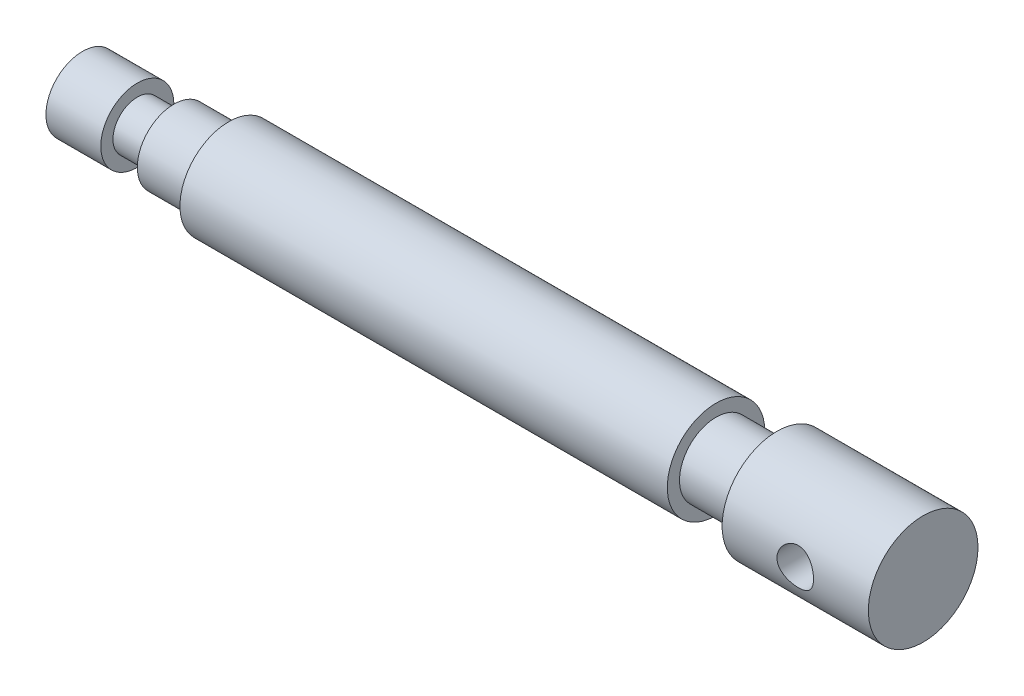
from build123d import *

# Parameters (mm, degrees)
SKETCH2_R          = 3
CUT_EXTRUDE1_DEPTH = 10


with BuildPart() as part:
    # Sketch1 → Revolve1 (revolve)
    with BuildSketch(Plane.XY, mode=Mode.PRIVATE) as revolve1_sk:
        Polygon((0, 0), (0, 6), (9, 6), (9, 4), (15, 4), (15, 6), (24, 6), (24, 8), (104, 8), (104, 6), (114, 6), (114, 9), (138, 9), (138, 0), align=None)
    revolve(revolve1_sk.sketch.rotate(Axis((0, 0, 0), (-1, 0, 0)), 90), axis=Axis((0, 0, 0), (-1, 0, 0)))

    # Sketch2 → Cut-Extrude1 (cut, symmetric)
    with BuildSketch(Plane.XY):
        with Locations((126, 0)):
            Circle(SKETCH2_R)
    extrude(amount=CUT_EXTRUDE1_DEPTH, both=True, mode=Mode.SUBTRACT)


solid = part.part
